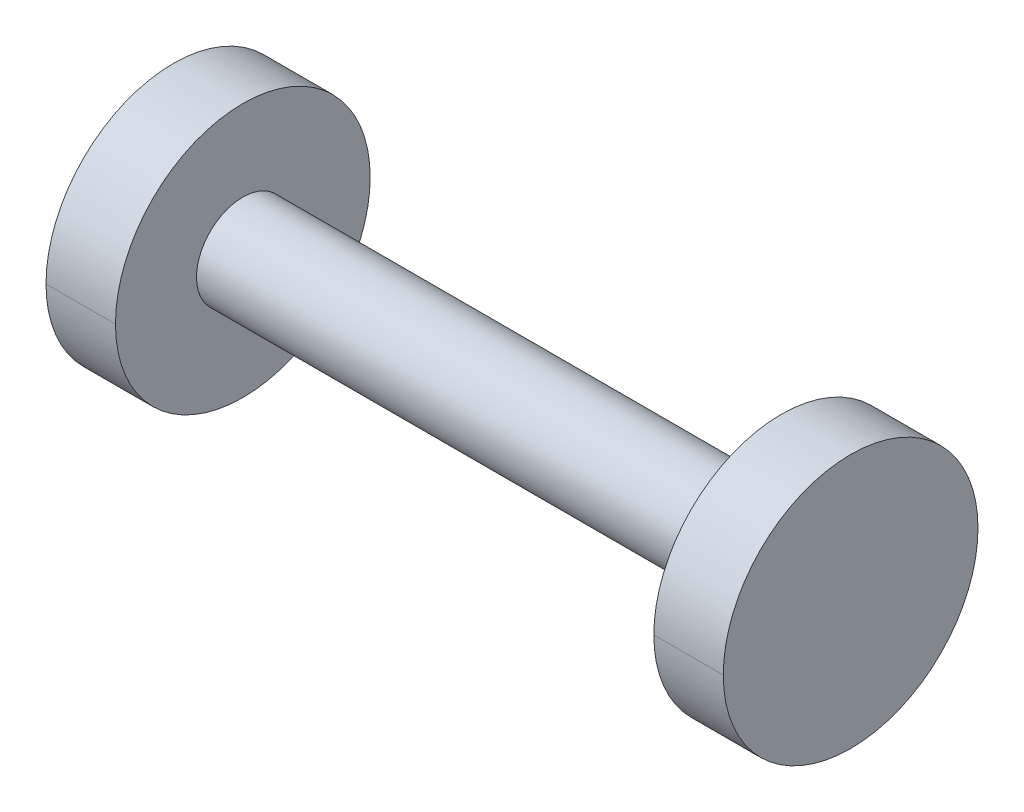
ISO-10303-21;
HEADER;
FILE_DESCRIPTION(('STEP AP214'),'2;1');
FILE_NAME('part.step','',(''),(''),'','','');
FILE_SCHEMA(('AUTOMOTIVE_DESIGN { 1 0 10303 214 1 1 1 1 }'));
ENDSEC;
DATA;
#1=APPLICATION_CONTEXT('core data for automotive mechanical design processes');
#2=APPLICATION_PROTOCOL_DEFINITION('international standard','automotive_design',2000,#1);
#3=PRODUCT_CONTEXT('',#1,'mechanical');
#4=PRODUCT('Part','Part','',(#3));
#5=PRODUCT_RELATED_PRODUCT_CATEGORY('part','',(#4));
#6=PRODUCT_DEFINITION_FORMATION('','',#4);
#7=PRODUCT_DEFINITION_CONTEXT('part definition',#1,'design');
#8=PRODUCT_DEFINITION('design','',#6,#7);
#9=PRODUCT_DEFINITION_SHAPE('','',#8);
#10=(LENGTH_UNIT() NAMED_UNIT(*) SI_UNIT(.MILLI.,.METRE.));
#11=(NAMED_UNIT(*) PLANE_ANGLE_UNIT() SI_UNIT($,.RADIAN.));
#12=(NAMED_UNIT(*) SI_UNIT($,.STERADIAN.) SOLID_ANGLE_UNIT());
#13=UNCERTAINTY_MEASURE_WITH_UNIT(LENGTH_MEASURE(1.E-05),#10,'distance_accuracy_value','');
#14=(GEOMETRIC_REPRESENTATION_CONTEXT(3) GLOBAL_UNCERTAINTY_ASSIGNED_CONTEXT((#13)) GLOBAL_UNIT_ASSIGNED_CONTEXT((#10,
#11,#12)) REPRESENTATION_CONTEXT('',''));
#15=CARTESIAN_POINT('',(0.,0.,0.));
#16=DIRECTION('',(0.,0.,1.));
#17=DIRECTION('',(1.,0.,0.));
#18=AXIS2_PLACEMENT_3D('',#15,#16,#17);
#19=CARTESIAN_POINT('',(-58.5,0.,0.));
#20=DIRECTION('',(1.,0.,0.));
#21=DIRECTION('',(0.,1.,0.));
#22=AXIS2_PLACEMENT_3D('',#19,#20,#21);
#23=CYLINDRICAL_SURFACE('',#22,11.);
#24=CARTESIAN_POINT('',(-6.00000000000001,0.,0.));
#25=DIRECTION('',(1.,0.,0.));
#26=DIRECTION('',(0.,1.,0.));
#27=AXIS2_PLACEMENT_3D('',#24,#25,#26);
#28=CIRCLE('',#27,11.);
#29=CARTESIAN_POINT('',(-6.00000000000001,0.,11.));
#30=VERTEX_POINT('',#29);
#31=CARTESIAN_POINT('',(-6.00000000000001,0.,-11.));
#32=VERTEX_POINT('',#31);
#33=EDGE_CURVE('E106',#30,#32,#28,.T.);
#34=ORIENTED_EDGE('',*,*,#33,.T.);
#35=DIRECTION('',(1.,0.,0.));
#36=VECTOR('',#35,1.);
#37=CARTESIAN_POINT('',(-58.5,0.,-11.));
#38=LINE('',#37,#36);
#39=CARTESIAN_POINT('',(0.,0.,-11.));
#40=VERTEX_POINT('',#39);
#41=EDGE_CURVE('E12',#32,#40,#38,.T.);
#42=ORIENTED_EDGE('',*,*,#41,.T.);
#43=CARTESIAN_POINT('',(0.,0.,0.));
#44=DIRECTION('',(1.,0.,0.));
#45=DIRECTION('',(0.,1.,0.));
#46=AXIS2_PLACEMENT_3D('',#43,#44,#45);
#47=CIRCLE('',#46,11.);
#48=CARTESIAN_POINT('',(0.,0.,11.));
#49=VERTEX_POINT('',#48);
#50=EDGE_CURVE('E93',#49,#40,#47,.T.);
#51=ORIENTED_EDGE('',*,*,#50,.F.);
#52=DIRECTION('',(-1.,0.,0.));
#53=VECTOR('',#52,1.);
#54=CARTESIAN_POINT('',(-58.5,0.,11.));
#55=LINE('',#54,#53);
#56=EDGE_CURVE('E47',#49,#30,#55,.T.);
#57=ORIENTED_EDGE('',*,*,#56,.T.);
#58=EDGE_LOOP('',(#34,#42,#51,#57));
#59=FACE_BOUND('',#58,.T.);
#60=ADVANCED_FACE('F39',(#59),#23,.T.);
#61=CARTESIAN_POINT('',(-58.5,0.,0.));
#62=DIRECTION('',(1.,0.,0.));
#63=DIRECTION('',(0.,1.,0.));
#64=AXIS2_PLACEMENT_3D('',#61,#62,#63);
#65=CYLINDRICAL_SURFACE('',#64,11.);
#66=CARTESIAN_POINT('',(-58.5,0.,0.));
#67=DIRECTION('',(1.,0.,0.));
#68=DIRECTION('',(0.,1.,0.));
#69=AXIS2_PLACEMENT_3D('',#66,#67,#68);
#70=CIRCLE('',#69,11.);
#71=CARTESIAN_POINT('',(-58.5,0.,11.));
#72=VERTEX_POINT('',#71);
#73=CARTESIAN_POINT('',(-58.5,0.,-11.));
#74=VERTEX_POINT('',#73);
#75=EDGE_CURVE('E87',#72,#74,#70,.T.);
#76=ORIENTED_EDGE('',*,*,#75,.T.);
#77=DIRECTION('',(1.,0.,0.));
#78=VECTOR('',#77,1.);
#79=CARTESIAN_POINT('',(-58.5,0.,-11.));
#80=LINE('',#79,#78);
#81=CARTESIAN_POINT('',(-52.5,0.,-11.));
#82=VERTEX_POINT('',#81);
#83=EDGE_CURVE('E83',#74,#82,#80,.T.);
#84=ORIENTED_EDGE('',*,*,#83,.T.);
#85=CARTESIAN_POINT('',(-52.5,0.,0.));
#86=DIRECTION('',(1.,0.,0.));
#87=DIRECTION('',(0.,1.,0.));
#88=AXIS2_PLACEMENT_3D('',#85,#86,#87);
#89=CIRCLE('',#88,11.);
#90=CARTESIAN_POINT('',(-52.5,0.,11.));
#91=VERTEX_POINT('',#90);
#92=EDGE_CURVE('E92',#91,#82,#89,.T.);
#93=ORIENTED_EDGE('',*,*,#92,.F.);
#94=DIRECTION('',(-1.,0.,0.));
#95=VECTOR('',#94,1.);
#96=CARTESIAN_POINT('',(-58.5,0.,11.));
#97=LINE('',#96,#95);
#98=EDGE_CURVE('E81',#91,#72,#97,.T.);
#99=ORIENTED_EDGE('',*,*,#98,.T.);
#100=EDGE_LOOP('',(#76,#84,#93,#99));
#101=FACE_BOUND('',#100,.T.);
#102=ADVANCED_FACE('F90',(#101),#65,.T.);
#103=CARTESIAN_POINT('',(0.,0.,0.));
#104=DIRECTION('',(1.,0.,0.));
#105=DIRECTION('',(0.,1.,0.));
#106=AXIS2_PLACEMENT_3D('',#103,#104,#105);
#107=PLANE('',#106);
#108=ORIENTED_EDGE('',*,*,#50,.T.);
#109=EDGE_CURVE('E108',#40,#49,#47,.T.);
#110=ORIENTED_EDGE('',*,*,#109,.T.);
#111=EDGE_LOOP('',(#108,#110));
#112=FACE_BOUND('',#111,.T.);
#113=ADVANCED_FACE('F41',(#112),#107,.T.);
#114=ORIENTED_EDGE('',*,*,#41,.F.);
#115=EDGE_CURVE('E105',#32,#30,#28,.T.);
#116=ORIENTED_EDGE('',*,*,#115,.T.);
#117=ORIENTED_EDGE('',*,*,#56,.F.);
#118=ORIENTED_EDGE('',*,*,#109,.F.);
#119=EDGE_LOOP('',(#114,#116,#117,#118));
#120=FACE_BOUND('',#119,.T.);
#121=ADVANCED_FACE('F116',(#120),#23,.T.);
#122=CARTESIAN_POINT('',(-6.,11.,0.));
#123=DIRECTION('',(-1.,0.,0.));
#124=DIRECTION('',(0.,-1.,0.));
#125=AXIS2_PLACEMENT_3D('',#122,#123,#124);
#126=PLANE('',#125);
#127=CARTESIAN_POINT('',(-6.,0.,0.));
#128=DIRECTION('',(1.,0.,0.));
#129=DIRECTION('',(0.,1.,0.));
#130=AXIS2_PLACEMENT_3D('',#127,#128,#129);
#131=CIRCLE('',#130,4.00000000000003);
#132=CARTESIAN_POINT('',(-6.,4.00000000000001,0.));
#133=VERTEX_POINT('',#132);
#134=EDGE_CURVE('E102',#133,#133,#131,.T.);
#135=ORIENTED_EDGE('',*,*,#134,.T.);
#136=EDGE_LOOP('',(#135));
#137=FACE_BOUND('',#136,.T.);
#138=ORIENTED_EDGE('',*,*,#33,.F.);
#139=ORIENTED_EDGE('',*,*,#115,.F.);
#140=EDGE_LOOP('',(#138,#139));
#141=FACE_BOUND('',#140,.T.);
#142=ADVANCED_FACE('F115',(#137,#141),#126,.T.);
#143=CARTESIAN_POINT('',(-58.5,0.,0.));
#144=DIRECTION('',(1.,0.,0.));
#145=DIRECTION('',(0.,1.,0.));
#146=AXIS2_PLACEMENT_3D('',#143,#144,#145);
#147=CYLINDRICAL_SURFACE('',#146,4.00000000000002);
#148=CARTESIAN_POINT('',(-52.5,0.,0.));
#149=DIRECTION('',(1.,0.,0.));
#150=DIRECTION('',(0.,1.,0.));
#151=AXIS2_PLACEMENT_3D('',#148,#149,#150);
#152=CIRCLE('',#151,4.);
#153=CARTESIAN_POINT('',(-52.5,3.99999999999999,0.));
#154=VERTEX_POINT('',#153);
#155=EDGE_CURVE('E99',#154,#154,#152,.T.);
#156=ORIENTED_EDGE('',*,*,#155,.T.);
#157=EDGE_LOOP('',(#156));
#158=FACE_BOUND('',#157,.T.);
#159=ORIENTED_EDGE('',*,*,#134,.F.);
#160=EDGE_LOOP('',(#159));
#161=FACE_BOUND('',#160,.T.);
#162=ADVANCED_FACE('F122',(#158,#161),#147,.T.);
#163=CARTESIAN_POINT('',(-52.5,3.99999999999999,0.));
#164=DIRECTION('',(1.,0.,0.));
#165=DIRECTION('',(0.,1.,0.));
#166=AXIS2_PLACEMENT_3D('',#163,#164,#165);
#167=PLANE('',#166);
#168=ORIENTED_EDGE('',*,*,#92,.T.);
#169=EDGE_CURVE('E96',#82,#91,#89,.T.);
#170=ORIENTED_EDGE('',*,*,#169,.T.);
#171=EDGE_LOOP('',(#168,#170));
#172=FACE_BOUND('',#171,.T.);
#173=ORIENTED_EDGE('',*,*,#155,.F.);
#174=EDGE_LOOP('',(#173));
#175=FACE_BOUND('',#174,.T.);
#176=ADVANCED_FACE('F136',(#172,#175),#167,.T.);
#177=ORIENTED_EDGE('',*,*,#83,.F.);
#178=EDGE_CURVE('E77',#74,#72,#70,.T.);
#179=ORIENTED_EDGE('',*,*,#178,.T.);
#180=ORIENTED_EDGE('',*,*,#98,.F.);
#181=ORIENTED_EDGE('',*,*,#169,.F.);
#182=EDGE_LOOP('',(#177,#179,#180,#181));
#183=FACE_BOUND('',#182,.T.);
#184=ADVANCED_FACE('F79',(#183),#65,.T.);
#185=CARTESIAN_POINT('',(-58.5,11.,0.));
#186=DIRECTION('',(-1.,0.,0.));
#187=DIRECTION('',(0.,-1.,0.));
#188=AXIS2_PLACEMENT_3D('',#185,#186,#187);
#189=PLANE('',#188);
#190=ORIENTED_EDGE('',*,*,#75,.F.);
#191=ORIENTED_EDGE('',*,*,#178,.F.);
#192=EDGE_LOOP('',(#190,#191));
#193=FACE_BOUND('',#192,.T.);
#194=ADVANCED_FACE('F95',(#193),#189,.T.);
#195=CLOSED_SHELL('',(#60,#102,#113,#121,#142,#162,#176,#184,#194));
#196=MANIFOLD_SOLID_BREP('B2',#195);
#197=ADVANCED_BREP_SHAPE_REPRESENTATION('',(#18,#196),#14);
#198=SHAPE_DEFINITION_REPRESENTATION(#9,#197);
ENDSEC;
END-ISO-10303-21;
